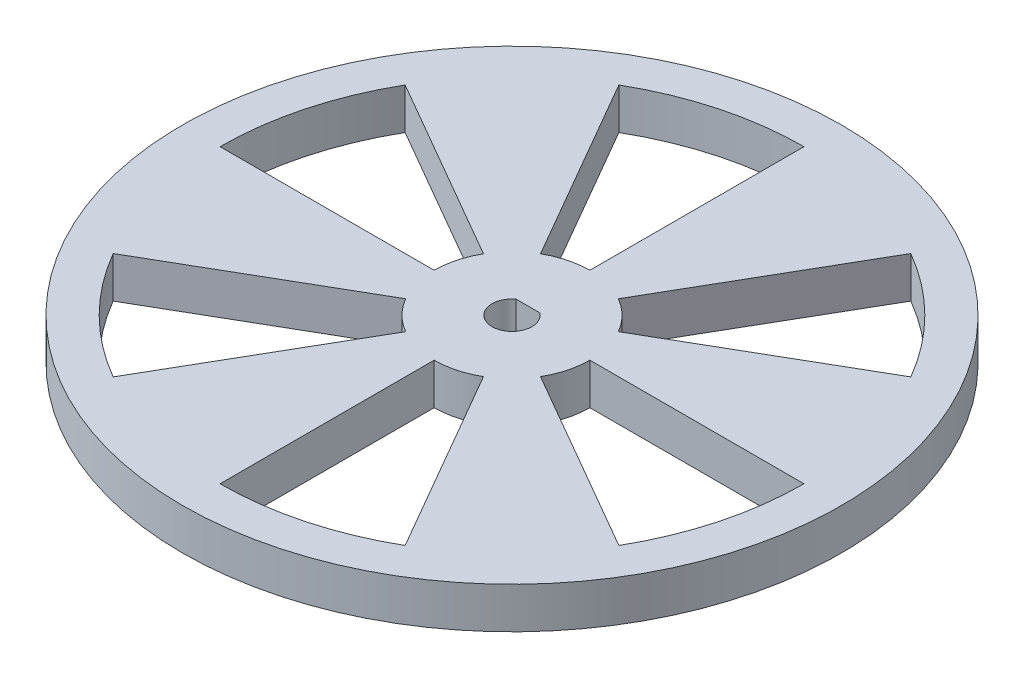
from build123d import *

# Parameters (mm, degrees)
SKETCH1_R      = 50.8
EXTRUDE1_DEPTH = 6.35


with BuildPart() as part:
    # Sketch1 → Extrude1 (new body)
    with BuildSketch(Plane(origin=(0, 0, 0), x_dir=(1, 0, 0), z_dir=(0, 1, 0))):
        with Locations(Location((0, 0, 0), (0, 0, 270))):
            Circle(SKETCH1_R)
        with BuildLine():
            Line((0, -12), (0, -45))
            ThreePointArc((0, -45), (11.64685703, -43.466662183), (22.5, -38.97114317))
            Line((22.5, -38.97114317), (6, -10.392304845))
            ThreePointArc((6, -10.392304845), (3.105828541, -11.591109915), (0, -12))
        make_face(mode=Mode.SUBTRACT)
        with BuildLine():
            Line((-6, 10.392304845), (-22.5, 38.97114317))
            ThreePointArc((-22.5, 38.97114317), (-11.64685703, 43.466662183), (0, 45))
            Line((0, 45), (0, 12))
            ThreePointArc((0, 12), (-3.105828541, 11.591109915), (-6, 10.392304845))
        make_face(mode=Mode.SUBTRACT)
        with BuildLine():
            Line((-10.392304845, 6), (-38.97114317, 22.5))
            ThreePointArc((-38.97114317, 22.5), (-43.466662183, 11.64685703), (-45, 0))
            Line((-45, 0), (-12, 0))
            ThreePointArc((-12, 0), (-11.591109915, 3.105828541), (-10.392304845, 6))
        make_face(mode=Mode.SUBTRACT)
        with BuildLine():
            Line((1.831876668, 2.46356), (-1.831876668, 2.46356))
            ThreePointArc((-1.831876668, 2.46356), (0, -3.07), (1.831876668, 2.46356))
        make_face(mode=Mode.SUBTRACT)
        with BuildLine():
            Line((10.392304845, 6), (38.97114317, 22.5))
            ThreePointArc((38.97114317, 22.5), (31.819805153, 31.819805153), (22.5, 38.97114317))
            Line((22.5, 38.97114317), (6, 10.392304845))
            ThreePointArc((6, 10.392304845), (8.485281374, 8.485281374), (10.392304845, 6))
        make_face(mode=Mode.SUBTRACT)
        with BuildLine():
            Line((10.392304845, -6), (38.97114317, -22.5))
            ThreePointArc((38.97114317, -22.5), (43.466662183, -11.64685703), (45, 0))
            Line((45, 0), (12, 0))
            ThreePointArc((12, 0), (11.591109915, -3.105828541), (10.392304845, -6))
        make_face(mode=Mode.SUBTRACT)
        with BuildLine():
            Line((-10.392304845, -6), (-38.97114317, -22.5))
            ThreePointArc((-38.97114317, -22.5), (-31.819805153, -31.819805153), (-22.5, -38.97114317))
            Line((-22.5, -38.97114317), (-6, -10.392304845))
            ThreePointArc((-6, -10.392304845), (-8.485281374, -8.485281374), (-10.392304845, -6))
        make_face(mode=Mode.SUBTRACT)
    extrude(amount=EXTRUDE1_DEPTH)


solid = part.part
